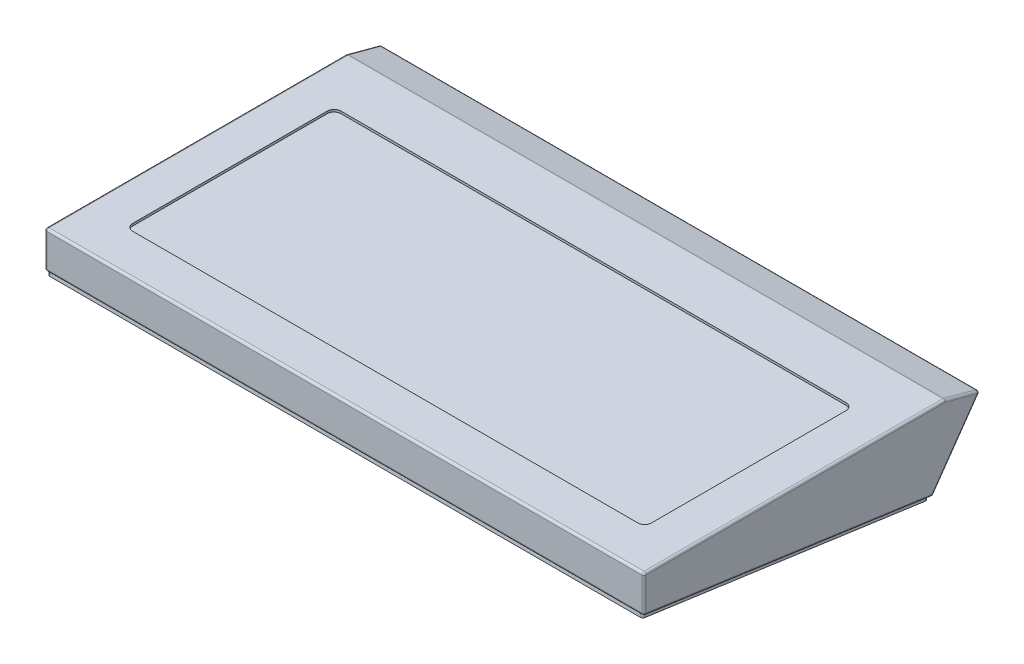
from build123d import *

# Parameters (mm, degrees)
ENCLOSURE_BODY_DEPTH               = 208.28
RADII_R                            = 1.524
KEYS_EXTRUDE_DEPTH                 = 1.6002
SUB_PANEL_EMBOSS_DEPTH             = 2.286
SKETCH11_R                         = 9.525
GORE_VENT_DEPTH                    = 6.35
SKETCH13_R                         = 8.382
CABLE_SEAL_AND_STRAIN_RELIEF_DEPTH = 53.975
DRAFT2_ANGLE                       = 3
FILLET1_R                          = 1.524
SKETCH14_R                         = 2.4765
CABLE_DEPICTION_DEPTH              = 53.975
TAP_DRILL_FOR_M6X1_0_TAP1_D        = 5
TAP_DRILL_FOR_M6X1_0_TAP1_DEPTH    = 22.86
TAP_DRILL_FOR_M6X1_0_TAP1_TIP      = 1.502151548


with BuildPart() as part:
    # Sketch2 → Enclosure Body (new, symmetric)
    with BuildSketch(Plane(origin=(0, 0, 0), x_dir=(0, 0, -1), z_dir=(1, 0, 0))):
        Polygon((0, 0), (-209.55, 0), (-209.55, -25.654), (-8.600436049, -53.895619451), (24.534515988, -6.574003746), align=None)
    extrude(amount=ENCLOSURE_BODY_DEPTH, both=True)

    # Radii
    radii_edges = [part.edges().sort_by_distance(p)[0] for p in [
        (208.28, -12.827, 209.55),
        (208.28, -39.774809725, 109.075218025),
        (208.28, -30.234811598, -7.967039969),
        (208.28, -3.287001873, -12.267257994),
        (-208.28, -30.234811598, -7.967039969),
        (-208.28, -39.774809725, 109.075218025),
        (-208.28, -12.827, 209.55),
        (-208.28, 0, 104.775),
        (-208.28, -3.287001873, -12.267257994),
        (208.28, 0, 104.775),
        (0, -6.574003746, -24.534515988),
        (0, -53.895619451, 8.600436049),
        (0, -25.654, 209.55),
        (0, 0, 209.55),
        (0, 0, 0),
    ]]
    fillet(radii_edges, radius=RADII_R)

    # Sketch3 → Keys Extrude (cut)
    with BuildSketch(Plane(origin=(0, 0, 0), x_dir=(1, 0, 0), z_dir=(0, 1, 0))):
        with BuildLine():
            Line((-175.5648, -36.322), (175.5648, -36.322))
            ThreePointArc((175.5648, -36.322), (178.941376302, -37.720623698), (180.34, -41.0972))
            Line((180.34, -41.0972), (180.34, -176.3268))
            ThreePointArc((180.34, -176.3268), (178.941376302, -179.703376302), (175.5648, -181.102))
            Line((175.5648, -181.102), (-175.5648, -181.102))
            ThreePointArc((-175.5648, -181.102), (-178.941376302, -179.703376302), (-180.34, -176.3268))
            Line((-180.34, -176.3268), (-180.34, -41.0972))
            ThreePointArc((-180.34, -41.0972), (-178.941376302, -37.720623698), (-175.5648, -36.322))
        make_face()
    extrude(amount=-KEYS_EXTRUDE_DEPTH, mode=Mode.SUBTRACT)

    # Sketch4 → Sub-panel Emboss (add)
    with BuildSketch(Plane(origin=(0, -54.03700773, 7.594406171), x_dir=(1, 0, 0), z_dir=(0, -0.9902680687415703, 0.13917310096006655))):
        with BuildLine():
            Line((-205.232, 203.108702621), (205.232, 203.108702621))
            ThreePointArc((205.232, 203.108702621), (206.309630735, 202.662333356), (206.756, 201.584702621))
            Line((206.756, 201.584702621), (206.756, 4.480702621))
            ThreePointArc((206.756, 4.480702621), (206.309630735, 3.403071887), (205.232, 2.956702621))
            Line((205.232, 2.956702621), (-205.232, 2.956702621))
            ThreePointArc((-205.232, 2.956702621), (-206.309630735, 3.403071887), (-206.756, 4.480702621))
            Line((-206.756, 4.480702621), (-206.756, 201.584702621))
            ThreePointArc((-206.756, 201.584702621), (-206.309630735, 202.662333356), (-205.232, 203.108702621))
        make_face()
    extrude(amount=SUB_PANEL_EMBOSS_DEPTH)

    # Sketch11 → Gore Vent (add)
    with BuildSketch(Plane(origin=(0, -56.300760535, 7.91255588), x_dir=(1, 0, 0), z_dir=(0, -0.9902680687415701, 0.13917310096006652))):
        with Locations(Location((0, 103.032702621, 0), (0, 0, 270))):
            Circle(SKETCH11_R)
    extrude(amount=GORE_VENT_DEPTH)

    # Sketch13 → Cable Seal and Strain Relief (add)
    with BuildSketch(Plane(origin=(0, -95.128835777, 37.472244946), x_dir=(-1, 0, 0), z_dir=(0, 0.5735764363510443, 0.8191520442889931))):
        with Locations(Location((0, -78.5996811, 0), (0, 0, 90))):
            Circle(SKETCH13_R)
    extrude(amount=-CABLE_SEAL_AND_STRAIN_RELIEF_DEPTH)

    # Draft2
    draft2_faces = [part.faces().sort_by_distance(p)[0] for p in [
        (0, -39.357007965, -34.525263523),
    ]]
    draft(draft2_faces, Plane(origin=(208.28, -6.574003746, -24.534515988), x_dir=(0, -0.8191520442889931, 0.5735764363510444), z_dir=(0, -0.5735764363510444, -0.8191520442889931)), DRAFT2_ANGLE)

    # Fillet1
    fillet1_edges = [part.edges().sort_by_distance(p)[0] for p in [
        (0, -57.153545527, -55.009647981),
    ]]
    fillet(fillet1_edges, radius=FILLET1_R)

    # Sketch14 → Cable Depiction (add)
    with BuildSketch(Plane(origin=(0, -44.649020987, -63.765410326), x_dir=(1, 0, 0), z_dir=(0, -0.5735764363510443, -0.8191520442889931))):
        with Locations(Location((0, 20.818495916, 0), (0, 0, 90))):
            Circle(SKETCH14_R)
    extrude(amount=CABLE_DEPICTION_DEPTH)

    # Tap Drill for M6x1.0 Tap1
    with Locations(Plane(origin=(0, -13.690232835, -19.551678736), x_dir=(-1, 0, 0), z_dir=(0, -0.5735764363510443, -0.8191520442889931))):
        with Locations((-177.8, -2.479695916), (-177.8, -39.157295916), (177.8, -39.157295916), (177.8, -2.479695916)):
            Hole(TAP_DRILL_FOR_M6X1_0_TAP1_D / 2, depth=TAP_DRILL_FOR_M6X1_0_TAP1_DEPTH)
            with Locations((0, 0, -(TAP_DRILL_FOR_M6X1_0_TAP1_DEPTH + TAP_DRILL_FOR_M6X1_0_TAP1_TIP / 2))):  # 118° drill point
                Cone(0, TAP_DRILL_FOR_M6X1_0_TAP1_D / 2, TAP_DRILL_FOR_M6X1_0_TAP1_TIP, mode=Mode.SUBTRACT)


solid = part.part
